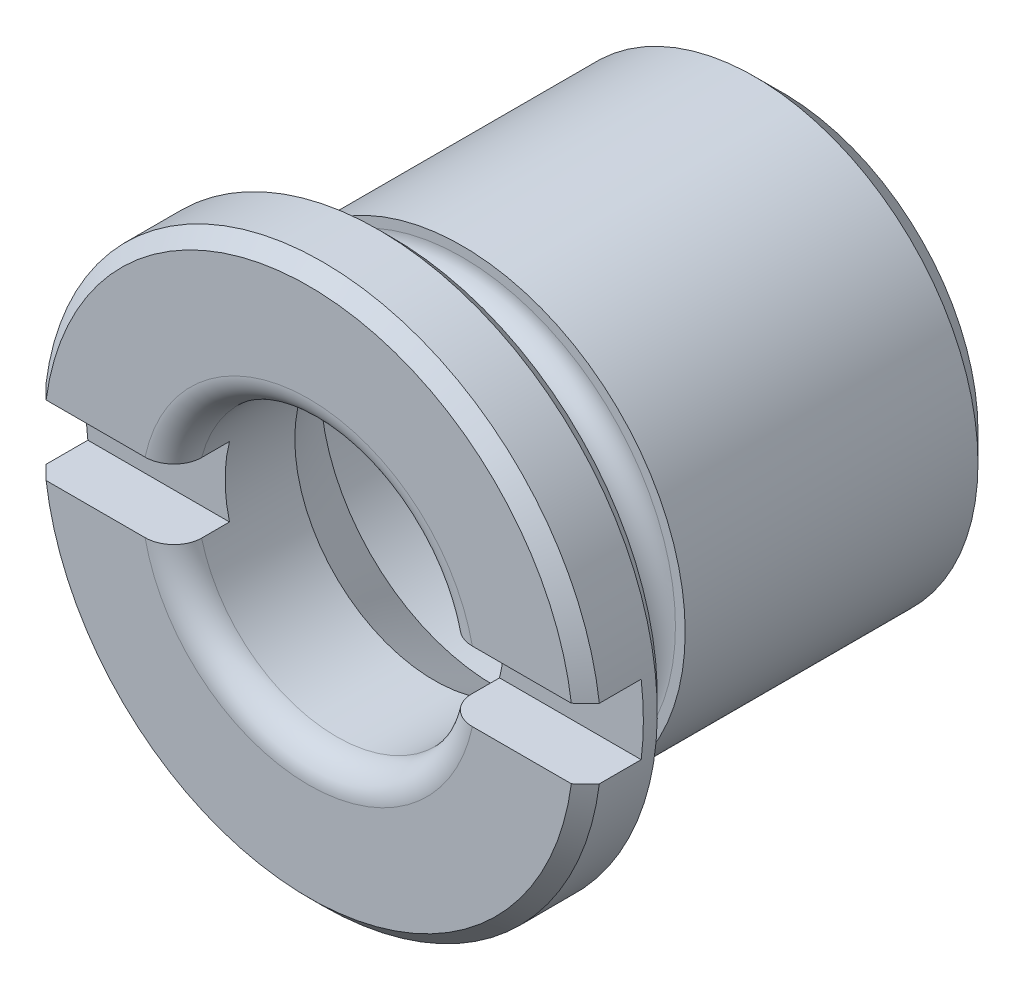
ISO-10303-21;
HEADER;
FILE_DESCRIPTION(('STEP AP214'),'2;1');
FILE_NAME('part.step','',(''),(''),'','','');
FILE_SCHEMA(('AUTOMOTIVE_DESIGN { 1 0 10303 214 1 1 1 1 }'));
ENDSEC;
DATA;
#1=APPLICATION_CONTEXT('core data for automotive mechanical design processes');
#2=APPLICATION_PROTOCOL_DEFINITION('international standard','automotive_design',2000,#1);
#3=PRODUCT_CONTEXT('',#1,'mechanical');
#4=PRODUCT('Part','Part','',(#3));
#5=PRODUCT_RELATED_PRODUCT_CATEGORY('part','',(#4));
#6=PRODUCT_DEFINITION_FORMATION('','',#4);
#7=PRODUCT_DEFINITION_CONTEXT('part definition',#1,'design');
#8=PRODUCT_DEFINITION('design','',#6,#7);
#9=PRODUCT_DEFINITION_SHAPE('','',#8);
#10=(LENGTH_UNIT() NAMED_UNIT(*) SI_UNIT(.MILLI.,.METRE.));
#11=(NAMED_UNIT(*) PLANE_ANGLE_UNIT() SI_UNIT($,.RADIAN.));
#12=(NAMED_UNIT(*) SI_UNIT($,.STERADIAN.) SOLID_ANGLE_UNIT());
#13=UNCERTAINTY_MEASURE_WITH_UNIT(LENGTH_MEASURE(1.E-05),#10,'distance_accuracy_value','');
#14=(GEOMETRIC_REPRESENTATION_CONTEXT(3) GLOBAL_UNCERTAINTY_ASSIGNED_CONTEXT((#13)) GLOBAL_UNIT_ASSIGNED_CONTEXT((#10,
#11,#12)) REPRESENTATION_CONTEXT('',''));
#15=CARTESIAN_POINT('',(0.,0.,0.));
#16=DIRECTION('',(0.,0.,1.));
#17=DIRECTION('',(1.,0.,0.));
#18=AXIS2_PLACEMENT_3D('',#15,#16,#17);
#19=CARTESIAN_POINT('',(0.,-10.,3.));
#20=DIRECTION('',(0.,0.,-1.));
#21=DIRECTION('',(1.,0.,0.));
#22=AXIS2_PLACEMENT_3D('',#19,#20,#21);
#23=PLANE('',#22);
#24=DIRECTION('',(1.,0.,0.));
#25=VECTOR('',#24,1.);
#26=CARTESIAN_POINT('',(-13.,1.25,3.));
#27=LINE('',#26,#25);
#28=CARTESIAN_POINT('',(-9.41740410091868,1.25,3.));
#29=VERTEX_POINT('',#28);
#30=CARTESIAN_POINT('',(-5.86834729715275,1.25,3.));
#31=VERTEX_POINT('',#30);
#32=EDGE_CURVE('E267',#29,#31,#27,.T.);
#33=ORIENTED_EDGE('',*,*,#32,.T.);
#34=CARTESIAN_POINT('',(0.,0.,3.));
#35=DIRECTION('',(0.,0.,-1.));
#36=DIRECTION('',(1.,0.,0.));
#37=AXIS2_PLACEMENT_3D('',#34,#35,#36);
#38=CIRCLE('',#37,6.);
#39=CARTESIAN_POINT('',(5.86834729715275,1.25,3.));
#40=VERTEX_POINT('',#39);
#41=EDGE_CURVE('E488',#31,#40,#38,.T.);
#42=ORIENTED_EDGE('',*,*,#41,.T.);
#43=CARTESIAN_POINT('',(9.41740410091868,1.25,3.));
#44=VERTEX_POINT('',#43);
#45=EDGE_CURVE('E271',#40,#44,#27,.T.);
#46=ORIENTED_EDGE('',*,*,#45,.T.);
#47=CARTESIAN_POINT('',(0.,0.,3.));
#48=DIRECTION('',(0.,0.,-1.));
#49=DIRECTION('',(1.,0.,0.));
#50=AXIS2_PLACEMENT_3D('',#47,#48,#49);
#51=CIRCLE('',#50,9.5);
#52=EDGE_CURVE('E129',#44,#29,#51,.F.);
#53=ORIENTED_EDGE('',*,*,#52,.T.);
#54=EDGE_LOOP('',(#33,#42,#46,#53));
#55=FACE_BOUND('',#54,.T.);
#56=ADVANCED_FACE('F14',(#55),#23,.F.);
#57=CARTESIAN_POINT('',(0.,0.,2.5));
#58=DIRECTION('',(0.,0.,-1.));
#59=DIRECTION('',(1.,0.,0.));
#60=AXIS2_PLACEMENT_3D('',#57,#58,#59);
#61=CONICAL_SURFACE('',#60,10.,0.785398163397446);
#62=CARTESIAN_POINT('',(-34.9249990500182,1.25,-22.4473612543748));
#63=CARTESIAN_POINT('',(-33.6050239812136,1.25,-21.1282397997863));
#64=CARTESIAN_POINT('',(-32.2850096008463,1.25,-19.8091576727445));
#65=CARTESIAN_POINT('',(-29.6447966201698,1.25,-17.1710883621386));
#66=CARTESIAN_POINT('',(-28.3245980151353,1.25,-15.8521011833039));
#67=CARTESIAN_POINT('',(-25.6834385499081,1.25,-13.2137661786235));
#68=CARTESIAN_POINT('',(-24.3624776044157,1.25,-11.8944184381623));
#69=CARTESIAN_POINT('',(-22.3808125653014,1.25,-9.91566439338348));
#70=CARTESIAN_POINT('',(-21.7202311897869,1.25,-9.25613519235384));
#71=CARTESIAN_POINT('',(-20.3989609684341,1.25,-7.9371859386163));
#72=CARTESIAN_POINT('',(-19.738272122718,1.25,-7.277765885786));
#73=CARTESIAN_POINT('',(-18.4167829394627,1.25,-5.9591041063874));
#74=CARTESIAN_POINT('',(-17.7559826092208,1.25,-5.29986237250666));
#75=CARTESIAN_POINT('',(-16.4341784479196,1.25,-3.98157740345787));
#76=CARTESIAN_POINT('',(-15.7731746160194,1.25,-3.32253416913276));
#77=CARTESIAN_POINT('',(-14.4508095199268,1.25,-2.00466842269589));
#78=CARTESIAN_POINT('',(-13.7894482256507,1.25,-1.34584594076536));
#79=CARTESIAN_POINT('',(-12.4662967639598,1.25,-0.0286520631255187));
#80=CARTESIAN_POINT('',(-11.8045066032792,1.25,0.629719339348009));
#81=CARTESIAN_POINT('',(-10.480398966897,1.25,1.94558408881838));
#82=CARTESIAN_POINT('',(-9.8180816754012,1.25,2.60307762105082));
#83=CARTESIAN_POINT('',(-8.82363334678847,1.25,3.58837586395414));
#84=CARTESIAN_POINT('',(-8.49197868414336,1.25,3.91666129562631));
#85=CARTESIAN_POINT('',(-7.82821795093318,1.25,4.57277183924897));
#86=CARTESIAN_POINT('',(-7.49611188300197,1.25,4.90059695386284));
#87=CARTESIAN_POINT('',(-6.83131072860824,1.25,5.55550265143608));
#88=CARTESIAN_POINT('',(-6.49861578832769,1.25,5.88258338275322));
#89=CARTESIAN_POINT('',(-5.83220406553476,1.25,6.53571886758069));
#90=CARTESIAN_POINT('',(-5.49848726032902,1.25,6.86177359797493));
#91=CARTESIAN_POINT('',(-4.99664594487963,1.25,7.3495190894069));
#92=CARTESIAN_POINT('',(-4.82916312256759,1.25,7.51186984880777));
#93=CARTESIAN_POINT('',(-4.49361606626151,1.25,7.83596915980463));
#94=CARTESIAN_POINT('',(-4.32555183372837,1.25,7.99771771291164));
#95=CARTESIAN_POINT('',(-3.98862713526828,1.25,8.32037167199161));
#96=CARTESIAN_POINT('',(-3.81976669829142,1.25,8.48127710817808));
#97=CARTESIAN_POINT('',(-3.48089973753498,1.25,8.80187571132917));
#98=CARTESIAN_POINT('',(-3.3108932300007,1.25,8.96156889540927));
#99=CARTESIAN_POINT('',(-3.09338846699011,1.25,9.16364551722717));
#100=CARTESIAN_POINT('',(-3.04669580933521,1.25,9.20689616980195));
#101=CARTESIAN_POINT('',(-2.95316112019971,1.25,9.29323589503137));
#102=CARTESIAN_POINT('',(-2.9063190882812,1.25,9.33632496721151));
#103=CARTESIAN_POINT('',(-2.76553895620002,1.25,9.46531914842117));
#104=CARTESIAN_POINT('',(-2.67134856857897,1.25,9.55094959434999));
#105=CARTESIAN_POINT('',(-2.4821041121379,1.25,9.72121708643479));
#106=CARTESIAN_POINT('',(-2.38705020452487,1.25,9.80585431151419));
#107=CARTESIAN_POINT('',(-2.19576352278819,1.25,9.97378347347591));
#108=CARTESIAN_POINT('',(-2.09953079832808,1.25,10.0570754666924));
#109=CARTESIAN_POINT('',(-1.93108626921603,1.25,10.1999628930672));
#110=CARTESIAN_POINT('',(-1.8592506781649,1.25,10.2600009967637));
#111=CARTESIAN_POINT('',(-1.71442752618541,1.25,10.3786716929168));
#112=CARTESIAN_POINT('',(-1.64144001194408,1.25,10.4373043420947));
#113=CARTESIAN_POINT('',(-1.49385024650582,1.25,10.5527025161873));
#114=CARTESIAN_POINT('',(-1.41924609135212,1.25,10.6094656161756));
#115=CARTESIAN_POINT('',(-1.26800117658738,1.25,10.7202077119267));
#116=CARTESIAN_POINT('',(-1.19136091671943,1.25,10.774187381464));
#117=CARTESIAN_POINT('',(-1.0635564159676,1.25,10.859182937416));
#118=CARTESIAN_POINT('',(-1.01321812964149,1.25,10.891435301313));
#119=CARTESIAN_POINT('',(-0.911171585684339,1.25,10.9536834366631));
#120=CARTESIAN_POINT('',(-0.859463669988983,1.25,10.9836797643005));
#121=CARTESIAN_POINT('',(-0.754462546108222,1.25,11.040625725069));
#122=CARTESIAN_POINT('',(-0.701171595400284,1.25,11.0675794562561));
#123=CARTESIAN_POINT('',(-0.592749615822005,1.25,11.1174192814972));
#124=CARTESIAN_POINT('',(-0.5376197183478,1.25,11.1403078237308));
#125=CARTESIAN_POINT('',(-0.408310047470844,1.25,11.1867636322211));
#126=CARTESIAN_POINT('',(-0.333407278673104,1.25,11.2084465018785));
#127=CARTESIAN_POINT('',(-0.219260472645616,1.25,11.2314639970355));
#128=CARTESIAN_POINT('',(-0.180958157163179,1.25,11.2375504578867));
#129=CARTESIAN_POINT('',(-0.103969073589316,1.25,11.2462652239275));
#130=CARTESIAN_POINT('',(-0.0652824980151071,1.25,11.2488951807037));
#131=CARTESIAN_POINT('',(0.0123793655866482,1.25,11.2505451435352));
#132=CARTESIAN_POINT('',(0.0513550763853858,1.25,11.2495453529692));
#133=CARTESIAN_POINT('',(0.129045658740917,1.25,11.2439542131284));
#134=CARTESIAN_POINT('',(0.167760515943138,1.25,11.239362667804));
#135=CARTESIAN_POINT('',(0.24472923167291,1.25,11.2268362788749));
#136=CARTESIAN_POINT('',(0.28298181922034,1.25,11.2188937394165));
#137=CARTESIAN_POINT('',(0.358744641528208,1.25,11.2000574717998));
#138=CARTESIAN_POINT('',(0.396254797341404,1.25,11.1891634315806));
#139=CARTESIAN_POINT('',(0.509603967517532,1.25,11.1520389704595));
#140=CARTESIAN_POINT('',(0.584116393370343,1.25,11.1217565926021));
#141=CARTESIAN_POINT('',(0.729801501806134,1.25,11.0539948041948));
#142=CARTESIAN_POINT('',(0.800967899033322,1.25,11.0165024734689));
#143=CARTESIAN_POINT('',(0.941097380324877,1.25,10.9364019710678));
#144=CARTESIAN_POINT('',(1.01003773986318,1.25,10.8937545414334));
#145=CARTESIAN_POINT('',(1.1117666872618,1.25,10.8273156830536));
#146=CARTESIAN_POINT('',(1.14538341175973,1.25,10.8047672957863));
#147=CARTESIAN_POINT('',(1.21213592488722,1.25,10.7589705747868));
#148=CARTESIAN_POINT('',(1.24527173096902,1.25,10.7357222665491));
#149=CARTESIAN_POINT('',(1.34966222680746,1.25,10.6610921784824));
#150=CARTESIAN_POINT('',(1.42014257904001,1.25,10.6086280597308));
#151=CARTESIAN_POINT('',(1.5596271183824,1.25,10.5017668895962));
#152=CARTESIAN_POINT('',(1.62863106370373,1.25,10.4473695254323));
#153=CARTESIAN_POINT('',(1.76553570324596,1.25,10.3371390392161));
#154=CARTESIAN_POINT('',(1.83343583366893,1.25,10.2813052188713));
#155=CARTESIAN_POINT('',(1.96835063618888,1.25,10.1685760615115));
#156=CARTESIAN_POINT('',(2.03536527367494,1.25,10.1116806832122));
#157=CARTESIAN_POINT('',(2.23560886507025,1.25,9.93958087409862));
#158=CARTESIAN_POINT('',(2.3677933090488,1.25,9.82316257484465));
#159=CARTESIAN_POINT('',(2.63031821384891,1.25,9.58835652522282));
#160=CARTESIAN_POINT('',(2.7606592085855,1.25,9.46996936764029));
#161=CARTESIAN_POINT('',(3.01971375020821,1.25,9.23219675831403));
#162=CARTESIAN_POINT('',(3.14843097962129,1.25,9.11281531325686));
#163=CARTESIAN_POINT('',(3.40499289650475,1.25,8.87310138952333));
#164=CARTESIAN_POINT('',(3.53283751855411,1.25,8.75276884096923));
#165=CARTESIAN_POINT('',(3.78773342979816,1.25,8.51155025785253));
#166=CARTESIAN_POINT('',(3.9147854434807,1.25,8.39066498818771));
#167=CARTESIAN_POINT('',(4.16839179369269,1.25,8.14838032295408));
#168=CARTESIAN_POINT('',(4.29494614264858,1.25,8.02698094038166));
#169=CARTESIAN_POINT('',(4.67282235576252,1.25,7.66336420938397));
#170=CARTESIAN_POINT('',(4.92358284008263,1.25,7.42056365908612));
#171=CARTESIAN_POINT('',(5.42415347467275,1.25,6.93398440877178));
#172=CARTESIAN_POINT('',(5.67396362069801,1.25,6.69020570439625));
#173=CARTESIAN_POINT('',(6.17294071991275,1.25,6.20198101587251));
#174=CARTESIAN_POINT('',(6.42210765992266,1.25,5.95753501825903));
#175=CARTESIAN_POINT('',(6.91998166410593,1.25,5.46817503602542));
#176=CARTESIAN_POINT('',(7.16868872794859,1.25,5.22326105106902));
#177=CARTESIAN_POINT('',(7.91453419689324,1.25,4.48779439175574));
#178=CARTESIAN_POINT('',(8.4111737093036,1.25,3.9967358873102));
#179=CARTESIAN_POINT('',(9.40368072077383,1.25,3.0138494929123));
#180=CARTESIAN_POINT('',(9.89954822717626,1.25,2.52202161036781));
#181=CARTESIAN_POINT('',(10.890758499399,1.25,1.53790069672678));
#182=CARTESIAN_POINT('',(11.3861012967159,1.25,1.04560769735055));
#183=CARTESIAN_POINT('',(12.3764564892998,1.25,0.0606870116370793));
#184=CARTESIAN_POINT('',(12.8714688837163,1.25,-0.431940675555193));
#185=CARTESIAN_POINT('',(13.8611849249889,1.25,-1.41735688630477));
#186=CARTESIAN_POINT('',(14.3558886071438,1.25,-1.91014537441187));
#187=CARTESIAN_POINT('',(15.3451226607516,1.25,-2.89589546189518));
#188=CARTESIAN_POINT('',(15.8396530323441,1.25,-3.38885706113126));
#189=CARTESIAN_POINT('',(17.9806735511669,1.25,-5.52362286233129));
#190=CARTESIAN_POINT('',(19.6265378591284,1.25,-7.16605468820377));
#191=CARTESIAN_POINT('',(22.9176569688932,1.25,-10.4515298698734));
#192=CARTESIAN_POINT('',(24.562911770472,1.25,-12.0945732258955));
#193=CARTESIAN_POINT('',(27.8531873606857,1.25,-15.3811111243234));
#194=CARTESIAN_POINT('',(29.4982081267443,1.25,-17.024605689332));
#195=CARTESIAN_POINT('',(32.7880452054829,1.25,-20.3117990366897));
#196=CARTESIAN_POINT('',(34.4328615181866,1.25,-21.9554978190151));
#197=CARTESIAN_POINT('',(39.3664755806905,1.25,-26.886147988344));
#198=CARTESIAN_POINT('',(42.6550793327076,1.25,-30.1732934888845));
#199=CARTESIAN_POINT('',(47.5876916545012,1.25,-35.1040867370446));
#200=CARTESIAN_POINT('',(49.2317922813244,1.25,-36.7476424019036));
#201=CARTESIAN_POINT('',(52.5199449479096,1.25,-40.0348022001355));
#202=CARTESIAN_POINT('',(54.1639969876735,1.25,-41.6784063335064));
#203=CARTESIAN_POINT('',(55.8080311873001,1.25,-43.3220283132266));
#204=B_SPLINE_CURVE_WITH_KNOTS('',3,(#62,#63,#64,#65,#66,#67,#68,#69,#70,#71,#72,#73,#74,#75,
#76,#77,#78,#79,#80,#81,#82,#83,#84,#85,#86,#87,#88,#89,#90,#91,#92,#93,#94,#95,#96,#97,#98,#99,
#100,#101,#102,#103,#104,#105,#106,#107,#108,#109,#110,#111,#112,#113,#114,#115,#116,#117,#118,
#119,#120,#121,#122,#123,#124,#125,#126,#127,#128,#129,#130,#131,#132,#133,#134,#135,#136,#137,
#138,#139,#140,#141,#142,#143,#144,#145,#146,#147,#148,#149,#150,#151,#152,#153,#154,#155,#156,
#157,#158,#159,#160,#161,#162,#163,#164,#165,#166,#167,#168,#169,#170,#171,#172,#173,#174,#175,
#176,#177,#178,#179,#180,#181,#182,#183,#184,#185,#186,#187,#188,#189,#190,#191,#192,#193,#194,
#195,#196,#197,#198,#199,#200,#201,#202,#203),.UNSPECIFIED.,.F.,.F.,(4,2,2,2,2,2,2,2,2,2,2,2,2,
2,2,2,2,2,2,2,2,2,2,2,2,2,2,2,2,2,2,2,2,2,2,2,2,2,2,2,2,2,2,2,2,2,2,2,2,2,2,2,2,2,2,2,2,2,2,2,2,
2,2,2,2,2,2,2,2,2,4),(0.,5.59836944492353,11.1969285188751,16.7978700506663,19.5982483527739,
22.3986234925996,25.1988574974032,27.9991032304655,30.799640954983,33.6001357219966,
36.399894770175,37.7998570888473,39.1998112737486,40.5994564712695,41.9991329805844,
42.6988993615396,43.3986639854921,44.0984033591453,44.7981328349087,44.9890707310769,
45.180009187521,45.5618932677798,45.9437074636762,46.325505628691,46.6063567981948,
46.8871966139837,47.1683873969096,47.449509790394,47.6288188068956,47.8080834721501,
47.9871037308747,48.1660158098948,48.3989844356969,48.5151998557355,48.63135972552,
48.7481540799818,48.8649548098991,48.9820252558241,49.0991080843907,49.3397528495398,
49.5808329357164,49.8238807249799,49.9453108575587,50.0667365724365,50.3302729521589,
50.5938521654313,50.8575620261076,51.1212821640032,51.6496686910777,52.1778989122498,
52.7045610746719,53.2312622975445,53.7573774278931,54.283479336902,55.3306115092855,
56.3777483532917,57.4249064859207,58.4720653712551,60.5673209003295,62.6625563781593,
64.7576580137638,66.8527650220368,68.9475561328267,71.0423455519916,78.0178783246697,
84.9934136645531,91.969408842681,98.9454032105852,112.894674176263,119.868846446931,
126.843018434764),.UNSPECIFIED.);
#205=CARTESIAN_POINT('',(9.92156741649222,1.25,2.5));
#206=VERTEX_POINT('',#205);
#207=EDGE_CURVE('E537',#206,#44,#204,.F.);
#208=ORIENTED_EDGE('',*,*,#207,.F.);
#209=CARTESIAN_POINT('',(0.,0.,2.5));
#210=DIRECTION('',(0.,0.,-1.));
#211=DIRECTION('',(1.,0.,0.));
#212=AXIS2_PLACEMENT_3D('',#209,#210,#211);
#213=CIRCLE('',#212,10.);
#214=CARTESIAN_POINT('',(-9.92156741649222,1.25,2.5));
#215=VERTEX_POINT('',#214);
#216=EDGE_CURVE('E251',#215,#206,#213,.T.);
#217=ORIENTED_EDGE('',*,*,#216,.F.);
#218=EDGE_CURVE('E116',#29,#215,#204,.F.);
#219=ORIENTED_EDGE('',*,*,#218,.F.);
#220=ORIENTED_EDGE('',*,*,#52,.F.);
#221=EDGE_LOOP('',(#208,#217,#219,#220));
#222=FACE_BOUND('',#221,.T.);
#223=ADVANCED_FACE('F196',(#222),#61,.T.);
#224=CARTESIAN_POINT('',(0.,-8.,-2.5));
#225=DIRECTION('',(0.,0.,-1.));
#226=DIRECTION('',(1.,0.,0.));
#227=AXIS2_PLACEMENT_3D('',#224,#225,#226);
#228=PLANE('',#227);
#229=CARTESIAN_POINT('',(0.,0.,-2.5));
#230=DIRECTION('',(0.,0.,-1.));
#231=DIRECTION('',(1.,0.,0.));
#232=AXIS2_PLACEMENT_3D('',#229,#230,#231);
#233=CIRCLE('',#232,7.65);
#234=CARTESIAN_POINT('',(7.65,0.,-2.5));
#235=VERTEX_POINT('',#234);
#236=EDGE_CURVE('E9',#235,#235,#233,.T.);
#237=ORIENTED_EDGE('',*,*,#236,.T.);
#238=EDGE_LOOP('',(#237));
#239=FACE_BOUND('',#238,.T.);
#240=CARTESIAN_POINT('',(0.,0.,-2.5));
#241=DIRECTION('',(0.,0.,-1.));
#242=DIRECTION('',(1.,0.,0.));
#243=AXIS2_PLACEMENT_3D('',#240,#241,#242);
#244=CIRCLE('',#243,8.);
#245=CARTESIAN_POINT('',(8.,0.,-2.5));
#246=VERTEX_POINT('',#245);
#247=EDGE_CURVE('E291',#246,#246,#244,.T.);
#248=ORIENTED_EDGE('',*,*,#247,.F.);
#249=EDGE_LOOP('',(#248));
#250=FACE_BOUND('',#249,.T.);
#251=ADVANCED_FACE('F203',(#239,#250),#228,.F.);
#252=CARTESIAN_POINT('',(0.,0.,-17.5262382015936));
#253=DIRECTION('',(0.,0.,-1.));
#254=DIRECTION('',(1.,0.,0.));
#255=AXIS2_PLACEMENT_3D('',#252,#253,#254);
#256=CYLINDRICAL_SURFACE('',#255,6.85);
#257=CARTESIAN_POINT('',(0.,0.,-0.8));
#258=DIRECTION('',(0.,0.,1.));
#259=DIRECTION('',(-1.,0.,0.));
#260=AXIS2_PLACEMENT_3D('',#257,#258,#259);
#261=CIRCLE('',#260,6.85);
#262=CARTESIAN_POINT('',(-6.85,0.,-0.8));
#263=VERTEX_POINT('',#262);
#264=EDGE_CURVE('E512',#263,#263,#261,.F.);
#265=ORIENTED_EDGE('',*,*,#264,.T.);
#266=EDGE_LOOP('',(#265));
#267=FACE_BOUND('',#266,.T.);
#268=CARTESIAN_POINT('',(0.,0.,-1.7));
#269=DIRECTION('',(0.,0.,-1.));
#270=DIRECTION('',(1.,0.,0.));
#271=AXIS2_PLACEMENT_3D('',#268,#269,#270);
#272=CIRCLE('',#271,6.85);
#273=CARTESIAN_POINT('',(6.85,0.,-1.7));
#274=VERTEX_POINT('',#273);
#275=EDGE_CURVE('E510',#274,#274,#272,.F.);
#276=ORIENTED_EDGE('',*,*,#275,.T.);
#277=EDGE_LOOP('',(#276));
#278=FACE_BOUND('',#277,.T.);
#279=ADVANCED_FACE('F224',(#267,#278),#256,.T.);
#280=CARTESIAN_POINT('',(0.,-10.,0.));
#281=DIRECTION('',(0.,0.,1.));
#282=DIRECTION('',(-1.,0.,0.));
#283=AXIS2_PLACEMENT_3D('',#280,#281,#282);
#284=PLANE('',#283);
#285=CARTESIAN_POINT('',(0.,0.,0.));
#286=DIRECTION('',(0.,0.,1.));
#287=DIRECTION('',(-1.,0.,0.));
#288=AXIS2_PLACEMENT_3D('',#285,#286,#287);
#289=CIRCLE('',#288,7.65);
#290=CARTESIAN_POINT('',(-7.65,0.,0.));
#291=VERTEX_POINT('',#290);
#292=EDGE_CURVE('E22',#291,#291,#289,.T.);
#293=ORIENTED_EDGE('',*,*,#292,.T.);
#294=EDGE_LOOP('',(#293));
#295=FACE_BOUND('',#294,.T.);
#296=CARTESIAN_POINT('',(0.,0.,0.));
#297=DIRECTION('',(0.,0.,1.));
#298=DIRECTION('',(-1.,0.,0.));
#299=AXIS2_PLACEMENT_3D('',#296,#297,#298);
#300=CIRCLE('',#299,9.5);
#301=CARTESIAN_POINT('',(-9.5,0.,0.));
#302=VERTEX_POINT('',#301);
#303=EDGE_CURVE('E249',#302,#302,#300,.F.);
#304=ORIENTED_EDGE('',*,*,#303,.T.);
#305=EDGE_LOOP('',(#304));
#306=FACE_BOUND('',#305,.T.);
#307=ADVANCED_FACE('F218',(#295,#306),#284,.F.);
#308=CARTESIAN_POINT('',(0.,0.,-17.5262382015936));
#309=DIRECTION('',(0.,0.,-1.));
#310=DIRECTION('',(1.,0.,0.));
#311=AXIS2_PLACEMENT_3D('',#308,#309,#310);
#312=CYLINDRICAL_SURFACE('',#311,10.);
#313=CARTESIAN_POINT('',(0.,0.,0.5));
#314=DIRECTION('',(0.,0.,1.));
#315=DIRECTION('',(-1.,0.,0.));
#316=AXIS2_PLACEMENT_3D('',#313,#314,#315);
#317=CIRCLE('',#316,10.);
#318=CARTESIAN_POINT('',(-10.,0.,0.5));
#319=VERTEX_POINT('',#318);
#320=EDGE_CURVE('E130',#319,#319,#317,.T.);
#321=ORIENTED_EDGE('',*,*,#320,.T.);
#322=EDGE_LOOP('',(#321));
#323=FACE_BOUND('',#322,.T.);
#324=CARTESIAN_POINT('',(0.,0.,1.));
#325=DIRECTION('',(0.,0.,-1.));
#326=DIRECTION('',(0.,1.,0.));
#327=AXIS2_PLACEMENT_3D('',#324,#325,#326);
#328=CIRCLE('',#327,10.);
#329=CARTESIAN_POINT('',(-9.92156741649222,-1.25,1.));
#330=VERTEX_POINT('',#329);
#331=CARTESIAN_POINT('',(-9.92156741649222,1.25,1.));
#332=VERTEX_POINT('',#331);
#333=EDGE_CURVE('E289',#330,#332,#328,.T.);
#334=ORIENTED_EDGE('',*,*,#333,.T.);
#335=DIRECTION('',(0.,0.,-1.));
#336=VECTOR('',#335,1.);
#337=CARTESIAN_POINT('',(-9.92156741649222,1.25,-17.5262382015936));
#338=LINE('',#337,#336);
#339=EDGE_CURVE('E279',#332,#215,#338,.F.);
#340=ORIENTED_EDGE('',*,*,#339,.T.);
#341=ORIENTED_EDGE('',*,*,#216,.T.);
#342=DIRECTION('',(0.,0.,-1.));
#343=VECTOR('',#342,1.);
#344=CARTESIAN_POINT('',(9.92156741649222,1.25,-17.5262382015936));
#345=LINE('',#344,#343);
#346=CARTESIAN_POINT('',(9.92156741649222,1.25,1.));
#347=VERTEX_POINT('',#346);
#348=EDGE_CURVE('E282',#206,#347,#345,.T.);
#349=ORIENTED_EDGE('',*,*,#348,.T.);
#350=CARTESIAN_POINT('',(9.92156741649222,-1.25,1.));
#351=VERTEX_POINT('',#350);
#352=EDGE_CURVE('E264',#347,#351,#328,.T.);
#353=ORIENTED_EDGE('',*,*,#352,.T.);
#354=DIRECTION('',(0.,0.,-1.));
#355=VECTOR('',#354,1.);
#356=CARTESIAN_POINT('',(9.92156741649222,-1.25,-17.5262382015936));
#357=LINE('',#356,#355);
#358=CARTESIAN_POINT('',(9.92156741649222,-1.25,2.5));
#359=VERTEX_POINT('',#358);
#360=EDGE_CURVE('E262',#351,#359,#357,.F.);
#361=ORIENTED_EDGE('',*,*,#360,.T.);
#362=CARTESIAN_POINT('',(-9.92156741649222,-1.25,2.5));
#363=VERTEX_POINT('',#362);
#364=EDGE_CURVE('E134',#359,#363,#213,.T.);
#365=ORIENTED_EDGE('',*,*,#364,.T.);
#366=DIRECTION('',(0.,0.,-1.));
#367=VECTOR('',#366,1.);
#368=CARTESIAN_POINT('',(-9.92156741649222,-1.25,-17.5262382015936));
#369=LINE('',#368,#367);
#370=EDGE_CURVE('E111',#363,#330,#369,.T.);
#371=ORIENTED_EDGE('',*,*,#370,.T.);
#372=EDGE_LOOP('',(#334,#340,#341,#349,#353,#361,#365,#371));
#373=FACE_BOUND('',#372,.T.);
#374=ADVANCED_FACE('F210',(#323,#373),#312,.T.);
#375=DIRECTION('',(1.,0.,0.));
#376=VECTOR('',#375,1.);
#377=CARTESIAN_POINT('',(-13.,-1.25,3.));
#378=LINE('',#377,#376);
#379=CARTESIAN_POINT('',(5.86834729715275,-1.25,3.));
#380=VERTEX_POINT('',#379);
#381=CARTESIAN_POINT('',(9.41740410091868,-1.25,3.));
#382=VERTEX_POINT('',#381);
#383=EDGE_CURVE('E125',#380,#382,#378,.T.);
#384=ORIENTED_EDGE('',*,*,#383,.F.);
#385=CARTESIAN_POINT('',(0.,0.,3.));
#386=DIRECTION('',(0.,0.,-1.));
#387=DIRECTION('',(1.,0.,0.));
#388=AXIS2_PLACEMENT_3D('',#385,#386,#387);
#389=CIRCLE('',#388,6.);
#390=CARTESIAN_POINT('',(-5.86834729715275,-1.25,3.));
#391=VERTEX_POINT('',#390);
#392=EDGE_CURVE('E123',#380,#391,#389,.T.);
#393=ORIENTED_EDGE('',*,*,#392,.T.);
#394=CARTESIAN_POINT('',(-9.41740410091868,-1.25,3.));
#395=VERTEX_POINT('',#394);
#396=EDGE_CURVE('E108',#395,#391,#378,.T.);
#397=ORIENTED_EDGE('',*,*,#396,.F.);
#398=EDGE_CURVE('E122',#395,#382,#51,.F.);
#399=ORIENTED_EDGE('',*,*,#398,.T.);
#400=EDGE_LOOP('',(#384,#393,#397,#399));
#401=FACE_BOUND('',#400,.T.);
#402=ADVANCED_FACE('F121',(#401),#23,.F.);
#403=CARTESIAN_POINT('',(0.,0.,-17.5262382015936));
#404=DIRECTION('',(0.,0.,-1.));
#405=DIRECTION('',(1.,0.,0.));
#406=AXIS2_PLACEMENT_3D('',#403,#404,#405);
#407=CYLINDRICAL_SURFACE('',#406,5.);
#408=DIRECTION('',(0.,0.,-1.));
#409=VECTOR('',#408,1.);
#410=CARTESIAN_POINT('',(4.84122918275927,1.25,-17.5262382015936));
#411=LINE('',#410,#409);
#412=CARTESIAN_POINT('',(4.84122918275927,1.25,1.));
#413=VERTEX_POINT('',#412);
#414=CARTESIAN_POINT('',(4.84122918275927,1.25,2.));
#415=VERTEX_POINT('',#414);
#416=EDGE_CURVE('E286',#413,#415,#411,.F.);
#417=ORIENTED_EDGE('',*,*,#416,.T.);
#418=CARTESIAN_POINT('',(0.,0.,2.));
#419=DIRECTION('',(0.,0.,-1.));
#420=DIRECTION('',(1.,0.,0.));
#421=AXIS2_PLACEMENT_3D('',#418,#419,#420);
#422=CIRCLE('',#421,5.);
#423=CARTESIAN_POINT('',(-4.84122918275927,1.25,2.));
#424=VERTEX_POINT('',#423);
#425=EDGE_CURVE('E486',#415,#424,#422,.F.);
#426=ORIENTED_EDGE('',*,*,#425,.T.);
#427=DIRECTION('',(0.,0.,-1.));
#428=VECTOR('',#427,1.);
#429=CARTESIAN_POINT('',(-4.84122918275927,1.25,-17.5262382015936));
#430=LINE('',#429,#428);
#431=CARTESIAN_POINT('',(-4.84122918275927,1.25,1.));
#432=VERTEX_POINT('',#431);
#433=EDGE_CURVE('E284',#424,#432,#430,.T.);
#434=ORIENTED_EDGE('',*,*,#433,.T.);
#435=CARTESIAN_POINT('',(0.,0.,1.));
#436=DIRECTION('',(0.,0.,-1.));
#437=DIRECTION('',(0.,1.,0.));
#438=AXIS2_PLACEMENT_3D('',#435,#436,#437);
#439=CIRCLE('',#438,5.);
#440=CARTESIAN_POINT('',(-4.84122918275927,-1.25,1.));
#441=VERTEX_POINT('',#440);
#442=EDGE_CURVE('E532',#432,#441,#439,.F.);
#443=ORIENTED_EDGE('',*,*,#442,.T.);
#444=DIRECTION('',(0.,0.,-1.));
#445=VECTOR('',#444,1.);
#446=CARTESIAN_POINT('',(-4.84122918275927,-1.25,-17.5262382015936));
#447=LINE('',#446,#445);
#448=CARTESIAN_POINT('',(-4.84122918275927,-1.25,2.));
#449=VERTEX_POINT('',#448);
#450=EDGE_CURVE('E276',#441,#449,#447,.F.);
#451=ORIENTED_EDGE('',*,*,#450,.T.);
#452=CARTESIAN_POINT('',(0.,0.,2.));
#453=DIRECTION('',(0.,0.,-1.));
#454=DIRECTION('',(1.,0.,0.));
#455=AXIS2_PLACEMENT_3D('',#452,#453,#454);
#456=CIRCLE('',#455,5.);
#457=CARTESIAN_POINT('',(4.84122918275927,-1.25,2.));
#458=VERTEX_POINT('',#457);
#459=EDGE_CURVE('E490',#449,#458,#456,.F.);
#460=ORIENTED_EDGE('',*,*,#459,.T.);
#461=DIRECTION('',(0.,0.,-1.));
#462=VECTOR('',#461,1.);
#463=CARTESIAN_POINT('',(4.84122918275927,-1.25,-17.5262382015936));
#464=LINE('',#463,#462);
#465=CARTESIAN_POINT('',(4.84122918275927,-1.25,1.));
#466=VERTEX_POINT('',#465);
#467=EDGE_CURVE('E269',#458,#466,#464,.T.);
#468=ORIENTED_EDGE('',*,*,#467,.T.);
#469=EDGE_CURVE('E538',#466,#413,#439,.F.);
#470=ORIENTED_EDGE('',*,*,#469,.T.);
#471=EDGE_LOOP('',(#417,#426,#434,#443,#451,#460,#468,#470));
#472=FACE_BOUND('',#471,.T.);
#473=CARTESIAN_POINT('',(0.,0.,-1.5));
#474=DIRECTION('',(0.,0.,-1.));
#475=DIRECTION('',(1.,0.,0.));
#476=AXIS2_PLACEMENT_3D('',#473,#474,#475);
#477=CIRCLE('',#476,5.);
#478=CARTESIAN_POINT('',(5.,0.,-1.5));
#479=VERTEX_POINT('',#478);
#480=EDGE_CURVE('E252',#479,#479,#477,.T.);
#481=ORIENTED_EDGE('',*,*,#480,.T.);
#482=EDGE_LOOP('',(#481));
#483=FACE_BOUND('',#482,.T.);
#484=ADVANCED_FACE('F209',(#472,#483),#407,.F.);
#485=CARTESIAN_POINT('',(0.,0.,-3.66506350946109));
#486=DIRECTION('',(0.,0.,-1.));
#487=DIRECTION('',(1.,0.,0.));
#488=AXIS2_PLACEMENT_3D('',#485,#486,#487);
#489=CONICAL_SURFACE('',#488,6.25,0.523598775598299);
#490=ORIENTED_EDGE('',*,*,#480,.F.);
#491=EDGE_LOOP('',(#490));
#492=FACE_BOUND('',#491,.T.);
#493=CARTESIAN_POINT('',(0.,0.,-3.66506350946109));
#494=DIRECTION('',(0.,0.,-1.));
#495=DIRECTION('',(1.,0.,0.));
#496=AXIS2_PLACEMENT_3D('',#493,#494,#495);
#497=CIRCLE('',#496,6.25);
#498=CARTESIAN_POINT('',(6.25,0.,-3.66506350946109));
#499=VERTEX_POINT('',#498);
#500=EDGE_CURVE('E256',#499,#499,#497,.T.);
#501=ORIENTED_EDGE('',*,*,#500,.T.);
#502=EDGE_LOOP('',(#501));
#503=FACE_BOUND('',#502,.T.);
#504=ADVANCED_FACE('F216',(#492,#503),#489,.F.);
#505=CARTESIAN_POINT('',(0.,0.,-17.5262382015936));
#506=DIRECTION('',(0.,0.,-1.));
#507=DIRECTION('',(1.,0.,0.));
#508=AXIS2_PLACEMENT_3D('',#505,#506,#507);
#509=CYLINDRICAL_SURFACE('',#508,6.25);
#510=ORIENTED_EDGE('',*,*,#500,.F.);
#511=EDGE_LOOP('',(#510));
#512=FACE_BOUND('',#511,.T.);
#513=CARTESIAN_POINT('',(0.,0.,-14.));
#514=DIRECTION('',(0.,0.,-1.));
#515=DIRECTION('',(1.,0.,0.));
#516=AXIS2_PLACEMENT_3D('',#513,#514,#515);
#517=CIRCLE('',#516,6.25);
#518=CARTESIAN_POINT('',(6.25,0.,-14.));
#519=VERTEX_POINT('',#518);
#520=EDGE_CURVE('E300',#519,#519,#517,.T.);
#521=ORIENTED_EDGE('',*,*,#520,.T.);
#522=EDGE_LOOP('',(#521));
#523=FACE_BOUND('',#522,.T.);
#524=ADVANCED_FACE('F306',(#512,#523),#509,.F.);
#525=CARTESIAN_POINT('',(0.,-7.,-14.));
#526=DIRECTION('',(0.,0.,1.));
#527=DIRECTION('',(-1.,0.,0.));
#528=AXIS2_PLACEMENT_3D('',#525,#526,#527);
#529=PLANE('',#528);
#530=ORIENTED_EDGE('',*,*,#520,.F.);
#531=EDGE_LOOP('',(#530));
#532=FACE_BOUND('',#531,.T.);
#533=CARTESIAN_POINT('',(0.,0.,-14.));
#534=DIRECTION('',(0.,0.,-1.));
#535=DIRECTION('',(1.,0.,0.));
#536=AXIS2_PLACEMENT_3D('',#533,#534,#535);
#537=CIRCLE('',#536,7.);
#538=CARTESIAN_POINT('',(7.,0.,-14.));
#539=VERTEX_POINT('',#538);
#540=EDGE_CURVE('E297',#539,#539,#537,.T.);
#541=ORIENTED_EDGE('',*,*,#540,.T.);
#542=EDGE_LOOP('',(#541));
#543=FACE_BOUND('',#542,.T.);
#544=ADVANCED_FACE('F309',(#532,#543),#529,.F.);
#545=CARTESIAN_POINT('',(0.,0.,-13.));
#546=DIRECTION('',(0.,0.,1.));
#547=DIRECTION('',(-1.,0.,0.));
#548=AXIS2_PLACEMENT_3D('',#545,#546,#547);
#549=CONICAL_SURFACE('',#548,8.,0.785398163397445);
#550=ORIENTED_EDGE('',*,*,#540,.F.);
#551=EDGE_LOOP('',(#550));
#552=FACE_BOUND('',#551,.T.);
#553=CARTESIAN_POINT('',(0.,0.,-13.));
#554=DIRECTION('',(0.,0.,-1.));
#555=DIRECTION('',(1.,0.,0.));
#556=AXIS2_PLACEMENT_3D('',#553,#554,#555);
#557=CIRCLE('',#556,8.);
#558=CARTESIAN_POINT('',(8.,0.,-13.));
#559=VERTEX_POINT('',#558);
#560=EDGE_CURVE('E294',#559,#559,#557,.T.);
#561=ORIENTED_EDGE('',*,*,#560,.T.);
#562=EDGE_LOOP('',(#561));
#563=FACE_BOUND('',#562,.T.);
#564=ADVANCED_FACE('F243',(#552,#563),#549,.T.);
#565=CARTESIAN_POINT('',(0.,0.,-17.5262382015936));
#566=DIRECTION('',(0.,0.,-1.));
#567=DIRECTION('',(1.,0.,0.));
#568=AXIS2_PLACEMENT_3D('',#565,#566,#567);
#569=CYLINDRICAL_SURFACE('',#568,8.);
#570=ORIENTED_EDGE('',*,*,#560,.F.);
#571=EDGE_LOOP('',(#570));
#572=FACE_BOUND('',#571,.T.);
#573=ORIENTED_EDGE('',*,*,#247,.T.);
#574=EDGE_LOOP('',(#573));
#575=FACE_BOUND('',#574,.T.);
#576=ADVANCED_FACE('F161',(#572,#575),#569,.T.);
#577=CARTESIAN_POINT('',(0.,0.,0.));
#578=DIRECTION('',(0.,0.,1.));
#579=DIRECTION('',(-1.,0.,0.));
#580=AXIS2_PLACEMENT_3D('',#577,#578,#579);
#581=CONICAL_SURFACE('',#580,9.5,0.785398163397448);
#582=ORIENTED_EDGE('',*,*,#320,.F.);
#583=EDGE_LOOP('',(#582));
#584=FACE_BOUND('',#583,.T.);
#585=ORIENTED_EDGE('',*,*,#303,.F.);
#586=EDGE_LOOP('',(#585));
#587=FACE_BOUND('',#586,.T.);
#588=ADVANCED_FACE('F234',(#584,#587),#581,.T.);
#589=CARTESIAN_POINT('',(-56.441421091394,-1.24999999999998,-43.9552611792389));
#590=CARTESIAN_POINT('',(-54.4988989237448,-1.24999999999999,-42.0132191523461));
#591=CARTESIAN_POINT('',(-52.5563558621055,-1.24999999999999,-40.0711980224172));
#592=CARTESIAN_POINT('',(-48.6712001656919,-1.24999999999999,-36.1872243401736));
#593=CARTESIAN_POINT('',(-46.7285875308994,-1.24999999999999,-34.2452717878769));
#594=CARTESIAN_POINT('',(-42.8432455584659,-1.24999999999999,-30.3614427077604));
#595=CARTESIAN_POINT('',(-40.9005162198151,-1.24999999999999,-28.4195661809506));
#596=CARTESIAN_POINT('',(-37.0149122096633,-1.24999999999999,-24.5359595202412));
#597=CARTESIAN_POINT('',(-35.0720375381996,-1.24999999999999,-22.5942293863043));
#598=CARTESIAN_POINT('',(-31.1732094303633,-1.24999999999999,-18.6981739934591));
#599=CARTESIAN_POINT('',(-29.2172544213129,-1.24999999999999,-16.7438503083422));
#600=CARTESIAN_POINT('',(-25.3049273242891,-1.24999999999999,-12.8356174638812));
#601=CARTESIAN_POINT('',(-23.3485552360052,-1.25,-10.881708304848));
#602=CARTESIAN_POINT('',(-20.4133502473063,-1.25,-7.95150865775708));
#603=CARTESIAN_POINT('',(-19.4348448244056,-1.25,-6.97489016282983));
#604=CARTESIAN_POINT('',(-17.4774847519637,-1.25,-5.02200260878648));
#605=CARTESIAN_POINT('',(-16.4986301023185,-1.25,-4.04573354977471));
#606=CARTESIAN_POINT('',(-14.5403534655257,-1.25,-2.09376710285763));
#607=CARTESIAN_POINT('',(-13.5609314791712,-1.25,-1.11806971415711));
#608=CARTESIAN_POINT('',(-12.0909888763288,-1.25,0.34466235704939));
#609=CARTESIAN_POINT('',(-11.6008731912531,-1.25,0.832103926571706));
#610=CARTESIAN_POINT('',(-10.6202452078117,-1.25,1.80658790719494));
#611=CARTESIAN_POINT('',(-10.1297329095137,-1.25,2.29363031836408));
#612=CARTESIAN_POINT('',(-9.28248644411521,-1.25,3.13383919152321));
#613=CARTESIAN_POINT('',(-8.92589513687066,-1.25,3.48714969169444));
#614=CARTESIAN_POINT('',(-8.21225642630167,-1.25,4.19331685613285));
#615=CARTESIAN_POINT('',(-7.85520901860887,-1.25,4.54617351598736));
#616=CARTESIAN_POINT('',(-7.14079824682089,-1.25,5.25085855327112));
#617=CARTESIAN_POINT('',(-6.78343554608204,-1.25,5.6026876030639));
#618=CARTESIAN_POINT('',(-6.06768370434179,-1.25,6.30528176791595));
#619=CARTESIAN_POINT('',(-5.70929459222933,-1.25,6.65604691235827));
#620=CARTESIAN_POINT('',(-5.15773107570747,-1.25,7.19313533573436));
#621=CARTESIAN_POINT('',(-4.96519222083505,-1.25,7.38011097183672));
#622=CARTESIAN_POINT('',(-4.57938121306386,-1.25,7.75333532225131));
#623=CARTESIAN_POINT('',(-4.38610900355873,-1.25,7.93958397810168));
#624=CARTESIAN_POINT('',(-3.99816846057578,-1.25,8.31135272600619));
#625=CARTESIAN_POINT('',(-3.80349818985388,-1.25,8.49687079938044));
#626=CARTESIAN_POINT('',(-3.41263891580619,-1.25,8.86620346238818));
#627=CARTESIAN_POINT('',(-3.21645031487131,-1.25,9.05001847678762));
#628=CARTESIAN_POINT('',(-2.86264918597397,-1.25,9.37691423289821));
#629=CARTESIAN_POINT('',(-2.70551134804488,-1.25,9.52050632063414));
#630=CARTESIAN_POINT('',(-2.46784429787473,-1.25,9.73385572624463));
#631=CARTESIAN_POINT('',(-2.38825920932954,-1.25,9.80466360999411));
#632=CARTESIAN_POINT('',(-2.22827231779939,-1.25,9.94534940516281));
#633=CARTESIAN_POINT('',(-2.14787053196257,-1.25,10.0152273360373));
#634=CARTESIAN_POINT('',(-1.9861357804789,-1.25,10.1536228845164));
#635=CARTESIAN_POINT('',(-1.9048046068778,-1.25,10.2221425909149));
#636=CARTESIAN_POINT('',(-1.74072716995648,-1.25,10.3574612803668));
#637=CARTESIAN_POINT('',(-1.6579810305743,-1.25,10.4242604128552));
#638=CARTESIAN_POINT('',(-1.49066121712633,-1.25,10.5552983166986));
#639=CARTESIAN_POINT('',(-1.40609022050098,-1.25,10.6195404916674));
#640=CARTESIAN_POINT('',(-1.23427257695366,-1.25,10.7443192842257));
#641=CARTESIAN_POINT('',(-1.14702729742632,-1.25,10.8048577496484));
#642=CARTESIAN_POINT('',(-1.0105461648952,-1.25,10.8930105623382));
#643=CARTESIAN_POINT('',(-0.962685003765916,-1.25,10.922744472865));
#644=CARTESIAN_POINT('',(-0.865647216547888,-1.25,10.9800311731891));
#645=CARTESIAN_POINT('',(-0.816470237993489,-1.25,11.0075833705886));
#646=CARTESIAN_POINT('',(-0.716687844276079,-1.25,11.0597431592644));
#647=CARTESIAN_POINT('',(-0.666085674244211,-1.25,11.0843568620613));
#648=CARTESIAN_POINT('',(-0.563216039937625,-1.25,11.1297532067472));
#649=CARTESIAN_POINT('',(-0.510949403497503,-1.25,11.15053771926));
#650=CARTESIAN_POINT('',(-0.384055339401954,-1.25,11.1941501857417));
#651=CARTESIAN_POINT('',(-0.308578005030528,-1.25,11.214674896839));
#652=CARTESIAN_POINT('',(-0.193689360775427,-1.25,11.2356455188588));
#653=CARTESIAN_POINT('',(-0.155152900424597,-1.25,11.2409991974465));
#654=CARTESIAN_POINT('',(-0.0777438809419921,-1.25,11.2481760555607));
#655=CARTESIAN_POINT('',(-0.0388713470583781,-1.25,11.2499994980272));
#656=CARTESIAN_POINT('',(0.0380100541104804,-1.25,11.2500004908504));
#657=CARTESIAN_POINT('',(0.0760189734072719,-1.25,11.2482579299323));
#658=CARTESIAN_POINT('',(0.151731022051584,-1.25,11.2413894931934));
#659=CARTESIAN_POINT('',(0.189434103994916,-1.25,11.2362631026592));
#660=CARTESIAN_POINT('',(0.264352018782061,-1.25,11.2228862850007));
#661=CARTESIAN_POINT('',(0.301565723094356,-1.25,11.2146296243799));
#662=CARTESIAN_POINT('',(0.375266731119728,-1.25,11.1953699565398));
#663=CARTESIAN_POINT('',(0.411753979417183,-1.25,11.1843667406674));
#664=CARTESIAN_POINT('',(0.526469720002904,-1.25,11.1456798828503));
#665=CARTESIAN_POINT('',(0.603223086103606,-1.25,11.1136185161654));
#666=CARTESIAN_POINT('',(0.753216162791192,-1.25,11.0421017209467));
#667=CARTESIAN_POINT('',(0.826448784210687,-1.25,11.0026320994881));
#668=CARTESIAN_POINT('',(0.970642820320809,-1.25,10.9184820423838));
#669=CARTESIAN_POINT('',(1.04158013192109,-1.25,10.8737608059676));
#670=CARTESIAN_POINT('',(1.14626207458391,-1.25,10.8041979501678));
#671=CARTESIAN_POINT('',(1.18085461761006,-1.25,10.7806072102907));
#672=CARTESIAN_POINT('',(1.24954941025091,-1.25,10.7327233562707));
#673=CARTESIAN_POINT('',(1.28365167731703,-1.25,10.7084302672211));
#674=CARTESIAN_POINT('',(1.39151573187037,-1.25,10.630183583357));
#675=CARTESIAN_POINT('',(1.46448026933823,-1.25,10.5751318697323));
#676=CARTESIAN_POINT('',(1.60890754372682,-1.25,10.4630866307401));
#677=CARTESIAN_POINT('',(1.68037004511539,-1.25,10.4060928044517));
#678=CARTESIAN_POINT('',(1.82217929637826,-1.25,10.2906698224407));
#679=CARTESIAN_POINT('',(1.89252550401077,-1.25,10.2322400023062));
#680=CARTESIAN_POINT('',(2.03232778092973,-1.25,10.1143232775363));
#681=CARTESIAN_POINT('',(2.10178381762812,-1.25,10.0548363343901));
#682=CARTESIAN_POINT('',(2.30935062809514,-1.25,9.87496944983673));
#683=CARTESIAN_POINT('',(2.44641637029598,-1.25,9.75338496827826));
#684=CARTESIAN_POINT('',(2.71871565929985,-1.25,9.50827129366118));
#685=CARTESIAN_POINT('',(2.85394971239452,-1.25,9.38474265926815));
#686=CARTESIAN_POINT('',(3.12272958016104,-1.25,9.1367779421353));
#687=CARTESIAN_POINT('',(3.25627957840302,-1.25,9.01234638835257));
#688=CARTESIAN_POINT('',(3.52251997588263,-1.25,8.7625499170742));
#689=CARTESIAN_POINT('',(3.65521031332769,-1.25,8.63718493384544));
#690=CARTESIAN_POINT('',(3.91981073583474,-1.25,8.38591442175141));
#691=CARTESIAN_POINT('',(4.0517214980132,-1.25,8.26000960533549));
#692=CARTESIAN_POINT('',(4.31505479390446,-1.25,8.00769713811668));
#693=CARTESIAN_POINT('',(4.4464773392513,-1.25,7.88128949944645));
#694=CARTESIAN_POINT('',(4.83905251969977,-1.25,7.50258618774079));
#695=CARTESIAN_POINT('',(5.09965530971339,-1.25,7.24972070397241));
#696=CARTESIAN_POINT('',(5.61992891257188,-1.25,6.74303232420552));
#697=CARTESIAN_POINT('',(5.8795997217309,-1.25,6.48920942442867));
#698=CARTESIAN_POINT('',(6.65769270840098,-1.25,5.72678356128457));
#699=CARTESIAN_POINT('',(7.17518578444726,-1.25,5.21723280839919));
#700=CARTESIAN_POINT('',(8.20913335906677,-1.25,4.19664273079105));
#701=CARTESIAN_POINT('',(8.72558732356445,-1.25,3.68560286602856));
#702=CARTESIAN_POINT('',(9.75773743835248,-1.25,2.66276733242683));
#703=CARTESIAN_POINT('',(10.2734335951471,-1.25,2.15097167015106));
#704=CARTESIAN_POINT('',(11.3044999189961,-1.25,1.12675370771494));
#705=CARTESIAN_POINT('',(11.8198699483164,-1.25,0.614331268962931));
#706=CARTESIAN_POINT('',(12.8502893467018,-1.25,-0.410838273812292));
#707=CARTESIAN_POINT('',(13.3653387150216,-1.25,-0.92358537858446));
#708=CARTESIAN_POINT('',(14.3951381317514,-1.25,-1.94923426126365));
#709=CARTESIAN_POINT('',(14.9098882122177,-1.25,-2.46213600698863));
#710=CARTESIAN_POINT('',(15.9392208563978,-1.25,-3.48810680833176));
#711=CARTESIAN_POINT('',(16.453803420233,-1.25,-4.0011758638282));
#712=CARTESIAN_POINT('',(18.6153386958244,-1.25,-6.156858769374));
#713=CARTESIAN_POINT('',(20.2617353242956,-1.25,-7.80003017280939));
#714=CARTESIAN_POINT('',(23.5539673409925,-1.24999999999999,-11.086936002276));
#715=CARTESIAN_POINT('',(25.1998027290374,-1.24999999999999,-12.7306704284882));
#716=CARTESIAN_POINT('',(28.4912557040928,-1.24999999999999,-16.0185598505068));
#717=CARTESIAN_POINT('',(30.1368732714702,-1.24999999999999,-17.6627148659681));
#718=CARTESIAN_POINT('',(33.4279156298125,-1.24999999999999,-20.9512174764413));
#719=CARTESIAN_POINT('',(35.0733404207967,-1.24999999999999,-22.5955650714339));
#720=CARTESIAN_POINT('',(40.0062590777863,-1.24999999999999,-27.5256230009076));
#721=CARTESIAN_POINT('',(43.2935689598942,-1.24999999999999,-30.8115174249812));
#722=CARTESIAN_POINT('',(48.2242550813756,-1.24999999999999,-35.7404342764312));
#723=CARTESIAN_POINT('',(49.8677197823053,-1.24999999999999,-37.3833682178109));
#724=CARTESIAN_POINT('',(53.1546024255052,-1.24999999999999,-40.6692827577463));
#725=CARTESIAN_POINT('',(54.7980203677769,-1.24999999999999,-42.3122633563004));
#726=CARTESIAN_POINT('',(56.441421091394,-1.24999999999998,-43.9552611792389));
#727=B_SPLINE_CURVE_WITH_KNOTS('',3,(#589,#590,#591,#592,#593,#594,#595,#596,#597,#598,#599,
#600,#601,#602,#603,#604,#605,#606,#607,#608,#609,#610,#611,#612,#613,#614,#615,#616,#617,#618,
#619,#620,#621,#622,#623,#624,#625,#626,#627,#628,#629,#630,#631,#632,#633,#634,#635,#636,#637,
#638,#639,#640,#641,#642,#643,#644,#645,#646,#647,#648,#649,#650,#651,#652,#653,#654,#655,#656,
#657,#658,#659,#660,#661,#662,#663,#664,#665,#666,#667,#668,#669,#670,#671,#672,#673,#674,#675,
#676,#677,#678,#679,#680,#681,#682,#683,#684,#685,#686,#687,#688,#689,#690,#691,#692,#693,#694,
#695,#696,#697,#698,#699,#700,#701,#702,#703,#704,#705,#706,#707,#708,#709,#710,#711,#712,#713,
#714,#715,#716,#717,#718,#719,#720,#721,#722,#723,#724,#725,#726),.UNSPECIFIED.,.F.,.F.,(4,2,2,
2,2,2,2,2,2,2,2,2,2,2,2,2,2,2,2,2,2,2,2,2,2,2,2,2,2,2,2,2,2,2,2,2,2,2,2,2,2,2,2,2,2,2,2,2,2,2,2,
2,2,2,2,2,2,2,2,2,2,2,2,2,2,2,2,2,4),(0.,8.24040511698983,16.4808123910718,24.7213060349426,
32.9617975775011,41.2567520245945,49.5517126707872,53.6991586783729,57.8466059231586,
61.9940473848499,64.0677671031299,66.1414864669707,67.647431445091,69.1533909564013,
70.6578586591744,72.1622844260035,72.967441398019,73.7726618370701,74.579390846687,
75.3859129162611,76.0244797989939,76.3440491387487,76.6636117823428,76.9826373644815,
77.3016351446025,77.6201930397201,77.9385906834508,78.1075831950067,78.2766214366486,
78.4453017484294,78.6138994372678,78.8475180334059,78.9640993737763,79.0806720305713,
79.1946617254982,79.3086687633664,79.4229040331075,79.5371479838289,79.7860062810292,
80.0353463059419,80.2867706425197,80.4123778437,80.5379805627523,80.8121367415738,
81.0863355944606,81.3606637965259,81.6350020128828,82.1846269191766,82.7340966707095,
83.2816933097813,83.8293288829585,84.3763849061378,84.9234278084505,86.0127775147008,
87.1021315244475,89.2808799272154,91.4605531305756,93.6402075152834,95.8204933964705,
98.0007843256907,100.180766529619,102.360747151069,109.338977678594,116.317210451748,
123.295872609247,130.274534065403,144.218406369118,151.189910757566,158.161414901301),.UNSPECIFIED.);
#728=EDGE_CURVE('E105',#363,#395,#727,.T.);
#729=ORIENTED_EDGE('',*,*,#728,.F.);
#730=ORIENTED_EDGE('',*,*,#364,.F.);
#731=EDGE_CURVE('E117',#382,#359,#727,.T.);
#732=ORIENTED_EDGE('',*,*,#731,.F.);
#733=ORIENTED_EDGE('',*,*,#398,.F.);
#734=EDGE_LOOP('',(#729,#730,#732,#733));
#735=FACE_BOUND('',#734,.T.);
#736=ADVANCED_FACE('F128',(#735),#61,.T.);
#737=CARTESIAN_POINT('',(-13.,-1.25,3.));
#738=DIRECTION('',(0.,-1.,0.));
#739=DIRECTION('',(0.,0.,-1.));
#740=AXIS2_PLACEMENT_3D('',#737,#738,#739);
#741=PLANE('',#740);
#742=ORIENTED_EDGE('',*,*,#467,.F.);
#743=CARTESIAN_POINT('',(4.84122918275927,-1.25,2.));
#744=CARTESIAN_POINT('',(4.84122879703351,-1.25,2.02752492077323));
#745=CARTESIAN_POINT('',(4.84240366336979,-1.25,2.05503637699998));
#746=CARTESIAN_POINT('',(4.84708685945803,-1.25,2.10985656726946));
#747=CARTESIAN_POINT('',(4.8505949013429,-1.25,2.13716532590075));
#748=CARTESIAN_POINT('',(4.86456928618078,-1.25,2.21839239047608));
#749=CARTESIAN_POINT('',(4.87848609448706,-1.25,2.27175711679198));
#750=CARTESIAN_POINT('',(4.91505048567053,-1.25,2.37537597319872));
#751=CARTESIAN_POINT('',(4.93769905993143,-1.25,2.42562974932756));
#752=CARTESIAN_POINT('',(4.99098855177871,-1.25,2.5217108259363));
#753=CARTESIAN_POINT('',(5.02163041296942,-1.25,2.5675376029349));
#754=CARTESIAN_POINT('',(5.09048450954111,-1.25,2.65424006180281));
#755=CARTESIAN_POINT('',(5.1288049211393,-1.25,2.69502972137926));
#756=CARTESIAN_POINT('',(5.21158401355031,-1.25,2.76982549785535));
#757=CARTESIAN_POINT('',(5.25604428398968,-1.25,2.80382985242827));
#758=CARTESIAN_POINT('',(5.35121923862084,-1.25,2.86510975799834));
#759=CARTESIAN_POINT('',(5.40207794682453,-1.25,2.8921614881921));
#760=CARTESIAN_POINT('',(5.50754334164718,-1.25,2.93753346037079));
#761=CARTESIAN_POINT('',(5.56214888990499,-1.25,2.95585634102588));
#762=CARTESIAN_POINT('',(5.65882609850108,-1.25,2.97968026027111));
#763=CARTESIAN_POINT('',(5.70039117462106,-1.25,2.98729110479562));
#764=CARTESIAN_POINT('',(5.78408144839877,-1.25,2.99745147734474));
#765=CARTESIAN_POINT('',(5.82620586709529,-1.25,3.00000742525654));
#766=CARTESIAN_POINT('',(5.86834729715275,-1.25,3.));
#767=B_SPLINE_CURVE_WITH_KNOTS('',3,(#743,#744,#745,#746,#747,#748,#749,#750,#751,#752,#753,
#754,#755,#756,#757,#758,#759,#760,#761,#762,#763,#764,#765,#766),.UNSPECIFIED.,.F.,.F.,(4,2,2,
2,2,2,2,2,2,2,2,4),(0.,0.0825231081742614,0.165036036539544,0.32963065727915,0.494243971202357,
0.658876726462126,0.82601651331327,0.993199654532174,1.16523279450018,1.33721389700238,
1.46368938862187,1.59000414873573),.UNSPECIFIED.);
#768=EDGE_CURVE('E37',#458,#380,#767,.T.);
#769=ORIENTED_EDGE('',*,*,#768,.T.);
#770=ORIENTED_EDGE('',*,*,#383,.T.);
#771=ORIENTED_EDGE('',*,*,#731,.T.);
#772=ORIENTED_EDGE('',*,*,#360,.F.);
#773=DIRECTION('',(1.,0.,0.));
#774=VECTOR('',#773,1.);
#775=CARTESIAN_POINT('',(-13.,-1.25,1.));
#776=LINE('',#775,#774);
#777=EDGE_CURVE('E124',#466,#351,#776,.T.);
#778=ORIENTED_EDGE('',*,*,#777,.F.);
#779=EDGE_LOOP('',(#742,#769,#770,#771,#772,#778));
#780=FACE_BOUND('',#779,.T.);
#781=ADVANCED_FACE('F159',(#780),#741,.F.);
#782=CARTESIAN_POINT('',(-13.,1.25,3.));
#783=DIRECTION('',(0.,1.,0.));
#784=DIRECTION('',(0.,0.,1.));
#785=AXIS2_PLACEMENT_3D('',#782,#783,#784);
#786=PLANE('',#785);
#787=ORIENTED_EDGE('',*,*,#45,.F.);
#788=CARTESIAN_POINT('',(5.86834729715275,1.25,3.));
#789=CARTESIAN_POINT('',(5.80955110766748,1.25,3.00004228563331));
#790=CARTESIAN_POINT('',(5.75076865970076,1.25,2.9950419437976));
#791=CARTESIAN_POINT('',(5.63487755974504,1.25,2.97530606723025));
#792=CARTESIAN_POINT('',(5.57776841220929,1.25,2.96057344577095));
#793=CARTESIAN_POINT('',(5.46680404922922,1.25,2.92171250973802));
#794=CARTESIAN_POINT('',(5.41295055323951,1.25,2.89757927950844));
#795=CARTESIAN_POINT('',(5.31010546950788,1.25,2.8405643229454));
#796=CARTESIAN_POINT('',(5.26111261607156,1.25,2.80768488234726));
#797=CARTESIAN_POINT('',(5.16977333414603,1.25,2.73428561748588));
#798=CARTESIAN_POINT('',(5.12738391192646,1.25,2.69381935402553));
#799=CARTESIAN_POINT('',(5.05019394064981,1.25,2.60617690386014));
#800=CARTESIAN_POINT('',(5.01539426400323,1.25,2.55899994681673));
#801=CARTESIAN_POINT('',(4.95530944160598,1.25,2.46048422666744));
#802=CARTESIAN_POINT('',(4.92981659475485,1.25,2.40927202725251));
#803=CARTESIAN_POINT('',(4.88810434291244,1.25,2.30322543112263));
#804=CARTESIAN_POINT('',(4.87187525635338,1.25,2.24839488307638));
#805=CARTESIAN_POINT('',(4.854138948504,1.25,2.16091151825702));
#806=CARTESIAN_POINT('',(4.84930093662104,1.25,2.12889929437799));
#807=CARTESIAN_POINT('',(4.84284701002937,1.25,2.06459678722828));
#808=CARTESIAN_POINT('',(4.84122662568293,1.25,2.03230695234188));
#809=CARTESIAN_POINT('',(4.84122918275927,1.25,2.));
#810=B_SPLINE_CURVE_WITH_KNOTS('',3,(#788,#789,#790,#791,#792,#793,#794,#795,#796,#797,#798,
#799,#800,#801,#802,#803,#804,#805,#806,#807,#808,#809),.UNSPECIFIED.,.F.,.F.,(4,2,2,2,2,2,2,2,
2,2,4),(0.,0.176157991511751,0.35226327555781,0.52846077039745,0.704612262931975,
0.87956405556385,1.05453594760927,1.22532196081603,1.39592915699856,1.4929107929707,
1.58975761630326),.UNSPECIFIED.);
#811=EDGE_CURVE('E501',#40,#415,#810,.T.);
#812=ORIENTED_EDGE('',*,*,#811,.T.);
#813=ORIENTED_EDGE('',*,*,#416,.F.);
#814=DIRECTION('',(1.,0.,0.));
#815=VECTOR('',#814,1.);
#816=CARTESIAN_POINT('',(-13.,1.25,1.));
#817=LINE('',#816,#815);
#818=EDGE_CURVE('E523',#413,#347,#817,.T.);
#819=ORIENTED_EDGE('',*,*,#818,.T.);
#820=ORIENTED_EDGE('',*,*,#348,.F.);
#821=ORIENTED_EDGE('',*,*,#207,.T.);
#822=EDGE_LOOP('',(#787,#812,#813,#819,#820,#821));
#823=FACE_BOUND('',#822,.T.);
#824=ADVANCED_FACE('F378',(#823),#786,.F.);
#825=CARTESIAN_POINT('',(-13.,-1.25,1.));
#826=DIRECTION('',(0.,0.,-1.));
#827=DIRECTION('',(0.,1.,0.));
#828=AXIS2_PLACEMENT_3D('',#825,#826,#827);
#829=PLANE('',#828);
#830=ORIENTED_EDGE('',*,*,#818,.F.);
#831=ORIENTED_EDGE('',*,*,#469,.F.);
#832=ORIENTED_EDGE('',*,*,#777,.T.);
#833=ORIENTED_EDGE('',*,*,#352,.F.);
#834=EDGE_LOOP('',(#830,#831,#832,#833));
#835=FACE_BOUND('',#834,.T.);
#836=ADVANCED_FACE('F160',(#835),#829,.F.);
#837=EDGE_CURVE('E521',#330,#441,#776,.T.);
#838=ORIENTED_EDGE('',*,*,#837,.T.);
#839=ORIENTED_EDGE('',*,*,#442,.F.);
#840=EDGE_CURVE('E526',#332,#432,#817,.T.);
#841=ORIENTED_EDGE('',*,*,#840,.F.);
#842=ORIENTED_EDGE('',*,*,#333,.F.);
#843=EDGE_LOOP('',(#838,#839,#841,#842));
#844=FACE_BOUND('',#843,.T.);
#845=ADVANCED_FACE('F390',(#844),#829,.F.);
#846=ORIENTED_EDGE('',*,*,#433,.F.);
#847=CARTESIAN_POINT('',(-4.84122918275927,1.25,2.));
#848=CARTESIAN_POINT('',(-4.84122879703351,1.25,2.02752492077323));
#849=CARTESIAN_POINT('',(-4.84240366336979,1.25,2.05503637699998));
#850=CARTESIAN_POINT('',(-4.84708685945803,1.25,2.10985656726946));
#851=CARTESIAN_POINT('',(-4.8505949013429,1.25,2.13716532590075));
#852=CARTESIAN_POINT('',(-4.86456928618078,1.25,2.21839239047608));
#853=CARTESIAN_POINT('',(-4.87848609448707,1.25,2.27175711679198));
#854=CARTESIAN_POINT('',(-4.91505048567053,1.25,2.37537597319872));
#855=CARTESIAN_POINT('',(-4.93769905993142,1.25,2.42562974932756));
#856=CARTESIAN_POINT('',(-4.99098855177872,1.25,2.5217108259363));
#857=CARTESIAN_POINT('',(-5.02163041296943,1.25,2.5675376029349));
#858=CARTESIAN_POINT('',(-5.09048450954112,1.25,2.65424006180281));
#859=CARTESIAN_POINT('',(-5.1288049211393,1.25,2.69502972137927));
#860=CARTESIAN_POINT('',(-5.21158401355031,1.25,2.76982549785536));
#861=CARTESIAN_POINT('',(-5.25604428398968,1.25,2.80382985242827));
#862=CARTESIAN_POINT('',(-5.35121923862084,1.25,2.86510975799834));
#863=CARTESIAN_POINT('',(-5.40207794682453,1.25,2.8921614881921));
#864=CARTESIAN_POINT('',(-5.50754334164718,1.25,2.93753346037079));
#865=CARTESIAN_POINT('',(-5.56214888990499,1.25,2.95585634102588));
#866=CARTESIAN_POINT('',(-5.65882609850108,1.25,2.97968026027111));
#867=CARTESIAN_POINT('',(-5.70039117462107,1.25,2.98729110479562));
#868=CARTESIAN_POINT('',(-5.78408144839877,1.25,2.99745147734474));
#869=CARTESIAN_POINT('',(-5.82620586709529,1.25,3.00000742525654));
#870=CARTESIAN_POINT('',(-5.86834729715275,1.25,3.));
#871=B_SPLINE_CURVE_WITH_KNOTS('',3,(#847,#848,#849,#850,#851,#852,#853,#854,#855,#856,#857,
#858,#859,#860,#861,#862,#863,#864,#865,#866,#867,#868,#869,#870),.UNSPECIFIED.,.F.,.F.,(4,2,2,
2,2,2,2,2,2,2,2,4),(0.,0.0825231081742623,0.165036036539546,0.32963065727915,0.494243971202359,
0.658876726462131,0.826016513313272,0.993199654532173,1.16523279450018,1.33721389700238,
1.46368938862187,1.59000414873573),.UNSPECIFIED.);
#872=EDGE_CURVE('E485',#424,#31,#871,.T.);
#873=ORIENTED_EDGE('',*,*,#872,.T.);
#874=ORIENTED_EDGE('',*,*,#32,.F.);
#875=ORIENTED_EDGE('',*,*,#218,.T.);
#876=ORIENTED_EDGE('',*,*,#339,.F.);
#877=ORIENTED_EDGE('',*,*,#840,.T.);
#878=EDGE_LOOP('',(#846,#873,#874,#875,#876,#877));
#879=FACE_BOUND('',#878,.T.);
#880=ADVANCED_FACE('F158',(#879),#786,.F.);
#881=ORIENTED_EDGE('',*,*,#396,.T.);
#882=CARTESIAN_POINT('',(-5.86834729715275,-1.25,3.));
#883=CARTESIAN_POINT('',(-5.80955110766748,-1.25,3.00004228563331));
#884=CARTESIAN_POINT('',(-5.75076865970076,-1.25,2.9950419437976));
#885=CARTESIAN_POINT('',(-5.63487755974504,-1.25,2.97530606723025));
#886=CARTESIAN_POINT('',(-5.57776841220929,-1.25,2.96057344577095));
#887=CARTESIAN_POINT('',(-5.46680404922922,-1.25,2.92171250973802));
#888=CARTESIAN_POINT('',(-5.41295055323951,-1.25,2.89757927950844));
#889=CARTESIAN_POINT('',(-5.31010546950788,-1.25,2.8405643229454));
#890=CARTESIAN_POINT('',(-5.26111261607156,-1.25,2.80768488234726));
#891=CARTESIAN_POINT('',(-5.16977333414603,-1.25,2.73428561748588));
#892=CARTESIAN_POINT('',(-5.12738391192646,-1.25,2.69381935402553));
#893=CARTESIAN_POINT('',(-5.05019394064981,-1.25,2.60617690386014));
#894=CARTESIAN_POINT('',(-5.01539426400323,-1.25,2.55899994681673));
#895=CARTESIAN_POINT('',(-4.95530944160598,-1.25,2.46048422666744));
#896=CARTESIAN_POINT('',(-4.92981659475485,-1.25,2.40927202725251));
#897=CARTESIAN_POINT('',(-4.88810434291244,-1.25,2.30322543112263));
#898=CARTESIAN_POINT('',(-4.87187525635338,-1.25,2.24839488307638));
#899=CARTESIAN_POINT('',(-4.854138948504,-1.25,2.16091151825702));
#900=CARTESIAN_POINT('',(-4.84930093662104,-1.25,2.12889929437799));
#901=CARTESIAN_POINT('',(-4.84284701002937,-1.25,2.06459678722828));
#902=CARTESIAN_POINT('',(-4.84122662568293,-1.25,2.03230695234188));
#903=CARTESIAN_POINT('',(-4.84122918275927,-1.25,2.));
#904=B_SPLINE_CURVE_WITH_KNOTS('',3,(#882,#883,#884,#885,#886,#887,#888,#889,#890,#891,#892,
#893,#894,#895,#896,#897,#898,#899,#900,#901,#902,#903),.UNSPECIFIED.,.F.,.F.,(4,2,2,2,2,2,2,2,
2,2,4),(0.,0.176157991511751,0.35226327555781,0.52846077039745,0.704612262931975,
0.87956405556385,1.05453594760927,1.22532196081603,1.39592915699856,1.4929107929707,
1.58975761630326),.UNSPECIFIED.);
#905=EDGE_CURVE('E29',#391,#449,#904,.T.);
#906=ORIENTED_EDGE('',*,*,#905,.T.);
#907=ORIENTED_EDGE('',*,*,#450,.F.);
#908=ORIENTED_EDGE('',*,*,#837,.F.);
#909=ORIENTED_EDGE('',*,*,#370,.F.);
#910=ORIENTED_EDGE('',*,*,#728,.T.);
#911=EDGE_LOOP('',(#881,#906,#907,#908,#909,#910));
#912=FACE_BOUND('',#911,.T.);
#913=ADVANCED_FACE('F107',(#912),#741,.F.);
#914=CARTESIAN_POINT('',(0.,0.,2.));
#915=DIRECTION('',(0.,0.,-1.));
#916=DIRECTION('',(1.,0.,0.));
#917=AXIS2_PLACEMENT_3D('',#914,#915,#916);
#918=TOROIDAL_SURFACE('',#917,6.,1.);
#919=ORIENTED_EDGE('',*,*,#872,.F.);
#920=ORIENTED_EDGE('',*,*,#425,.F.);
#921=ORIENTED_EDGE('',*,*,#811,.F.);
#922=ORIENTED_EDGE('',*,*,#41,.F.);
#923=EDGE_LOOP('',(#919,#920,#921,#922));
#924=FACE_BOUND('',#923,.T.);
#925=ADVANCED_FACE('F157',(#924),#918,.T.);
#926=CARTESIAN_POINT('',(0.,0.,2.));
#927=DIRECTION('',(0.,0.,-1.));
#928=DIRECTION('',(1.,0.,0.));
#929=AXIS2_PLACEMENT_3D('',#926,#927,#928);
#930=TOROIDAL_SURFACE('',#929,6.,1.);
#931=ORIENTED_EDGE('',*,*,#768,.F.);
#932=ORIENTED_EDGE('',*,*,#459,.F.);
#933=ORIENTED_EDGE('',*,*,#905,.F.);
#934=ORIENTED_EDGE('',*,*,#392,.F.);
#935=EDGE_LOOP('',(#931,#932,#933,#934));
#936=FACE_BOUND('',#935,.T.);
#937=ADVANCED_FACE('F179',(#936),#930,.T.);
#938=CARTESIAN_POINT('',(0.,0.,-0.8));
#939=DIRECTION('',(0.,0.,1.));
#940=DIRECTION('',(-1.,0.,0.));
#941=AXIS2_PLACEMENT_3D('',#938,#939,#940);
#942=TOROIDAL_SURFACE('',#941,7.65,0.8);
#943=ORIENTED_EDGE('',*,*,#292,.F.);
#944=EDGE_LOOP('',(#943));
#945=FACE_BOUND('',#944,.T.);
#946=ORIENTED_EDGE('',*,*,#264,.F.);
#947=EDGE_LOOP('',(#946));
#948=FACE_BOUND('',#947,.T.);
#949=ADVANCED_FACE('F182',(#945,#948),#942,.F.);
#950=CARTESIAN_POINT('',(0.,0.,-1.7));
#951=DIRECTION('',(0.,0.,-1.));
#952=DIRECTION('',(1.,0.,0.));
#953=AXIS2_PLACEMENT_3D('',#950,#951,#952);
#954=TOROIDAL_SURFACE('',#953,7.65,0.8);
#955=ORIENTED_EDGE('',*,*,#275,.F.);
#956=EDGE_LOOP('',(#955));
#957=FACE_BOUND('',#956,.T.);
#958=ORIENTED_EDGE('',*,*,#236,.F.);
#959=EDGE_LOOP('',(#958));
#960=FACE_BOUND('',#959,.T.);
#961=ADVANCED_FACE('F16',(#957,#960),#954,.F.);
#962=CLOSED_SHELL('',(#56,#223,#251,#279,#307,#374,#402,#484,#504,#524,#544,#564,#576,#588,#736,
#781,#824,#836,#845,#880,#913,#925,#937,#949,#961));
#963=MANIFOLD_SOLID_BREP('B1',#962);
#964=ADVANCED_BREP_SHAPE_REPRESENTATION('',(#18,#963),#14);
#965=SHAPE_DEFINITION_REPRESENTATION(#9,#964);
ENDSEC;
END-ISO-10303-21;
